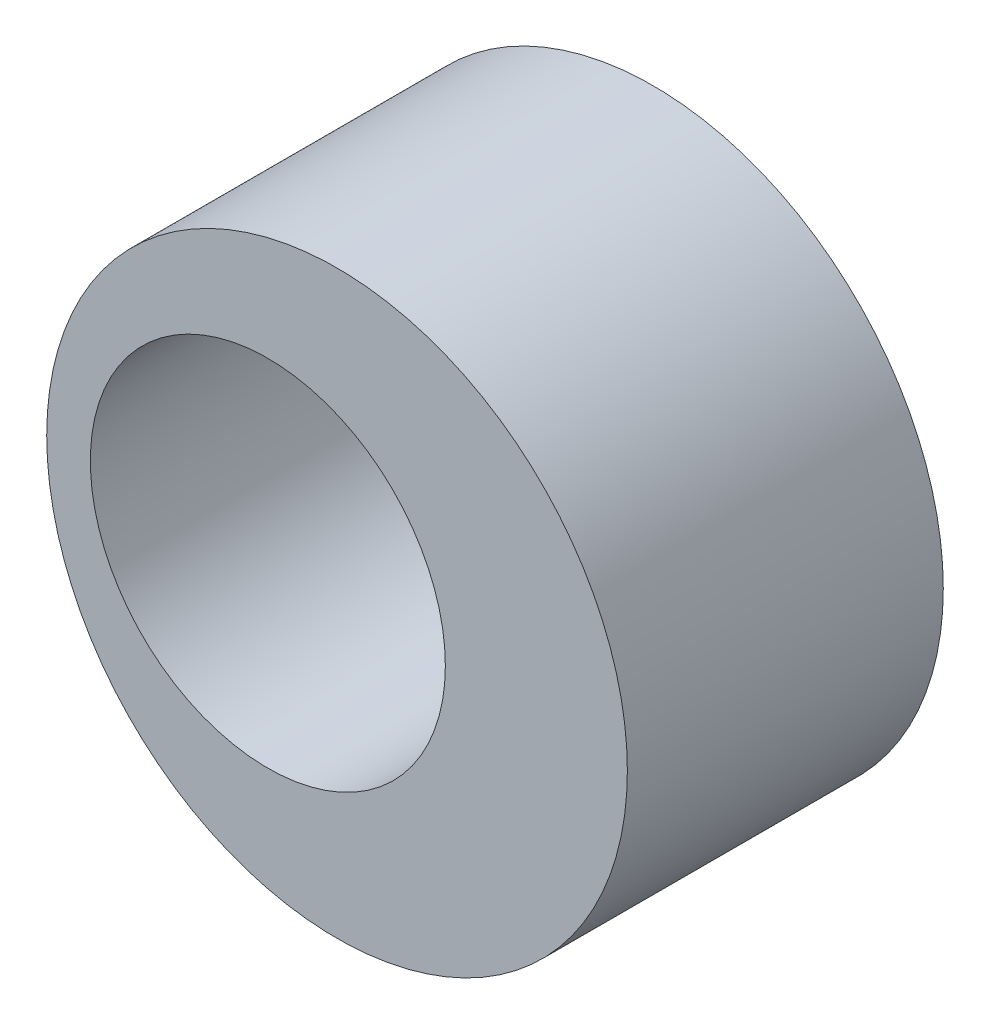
ISO-10303-21;
HEADER;
FILE_DESCRIPTION(('STEP AP214'),'2;1');
FILE_NAME('part.step','',(''),(''),'','','');
FILE_SCHEMA(('AUTOMOTIVE_DESIGN { 1 0 10303 214 1 1 1 1 }'));
ENDSEC;
DATA;
#1=APPLICATION_CONTEXT('core data for automotive mechanical design processes');
#2=APPLICATION_PROTOCOL_DEFINITION('international standard','automotive_design',2000,#1);
#3=PRODUCT_CONTEXT('',#1,'mechanical');
#4=PRODUCT('Part','Part','',(#3));
#5=PRODUCT_RELATED_PRODUCT_CATEGORY('part','',(#4));
#6=PRODUCT_DEFINITION_FORMATION('','',#4);
#7=PRODUCT_DEFINITION_CONTEXT('part definition',#1,'design');
#8=PRODUCT_DEFINITION('design','',#6,#7);
#9=PRODUCT_DEFINITION_SHAPE('','',#8);
#10=(LENGTH_UNIT() NAMED_UNIT(*) SI_UNIT(.MILLI.,.METRE.));
#11=(NAMED_UNIT(*) PLANE_ANGLE_UNIT() SI_UNIT($,.RADIAN.));
#12=(NAMED_UNIT(*) SI_UNIT($,.STERADIAN.) SOLID_ANGLE_UNIT());
#13=UNCERTAINTY_MEASURE_WITH_UNIT(LENGTH_MEASURE(1.E-05),#10,'distance_accuracy_value','');
#14=(GEOMETRIC_REPRESENTATION_CONTEXT(3) GLOBAL_UNCERTAINTY_ASSIGNED_CONTEXT((#13)) GLOBAL_UNIT_ASSIGNED_CONTEXT((#10,
#11,#12)) REPRESENTATION_CONTEXT('',''));
#15=CARTESIAN_POINT('',(0.,0.,0.));
#16=DIRECTION('',(0.,0.,1.));
#17=DIRECTION('',(1.,0.,0.));
#18=AXIS2_PLACEMENT_3D('',#15,#16,#17);
#19=CARTESIAN_POINT('',(1.1684,0.,5.715));
#20=DIRECTION('',(0.,0.,-1.));
#21=DIRECTION('',(-0.999999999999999,0.,0.));
#22=AXIS2_PLACEMENT_3D('',#19,#20,#21);
#23=CYLINDRICAL_SURFACE('',#22,4.9022);
#24=CARTESIAN_POINT('',(1.1684,0.,5.715));
#25=DIRECTION('',(0.,0.,1.));
#26=DIRECTION('',(0.999999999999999,0.,0.));
#27=AXIS2_PLACEMENT_3D('',#24,#25,#26);
#28=CIRCLE('',#27,4.9022);
#29=CARTESIAN_POINT('',(6.07059999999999,0.,5.715));
#30=VERTEX_POINT('',#29);
#31=EDGE_CURVE('E11',#30,#30,#28,.T.);
#32=ORIENTED_EDGE('',*,*,#31,.F.);
#33=EDGE_LOOP('',(#32));
#34=FACE_BOUND('',#33,.T.);
#35=CARTESIAN_POINT('',(1.1684,0.,0.380999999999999));
#36=DIRECTION('',(0.,0.,-1.));
#37=DIRECTION('',(-0.999999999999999,0.,0.));
#38=AXIS2_PLACEMENT_3D('',#35,#36,#37);
#39=CIRCLE('',#38,4.9022);
#40=CARTESIAN_POINT('',(-3.73379999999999,0.,0.380999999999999));
#41=VERTEX_POINT('',#40);
#42=EDGE_CURVE('E34',#41,#41,#39,.T.);
#43=ORIENTED_EDGE('',*,*,#42,.F.);
#44=EDGE_LOOP('',(#43));
#45=FACE_BOUND('',#44,.T.);
#46=ADVANCED_FACE('F31',(#34,#45),#23,.T.);
#47=CARTESIAN_POINT('',(1.1684,0.,0.));
#48=DIRECTION('',(0.,0.,1.));
#49=DIRECTION('',(0.999999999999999,0.,0.));
#50=AXIS2_PLACEMENT_3D('',#47,#48,#49);
#51=PLANE('',#50);
#52=CARTESIAN_POINT('',(0.,0.,0.));
#53=DIRECTION('',(0.,0.,1.));
#54=DIRECTION('',(0.999999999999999,0.,0.));
#55=AXIS2_PLACEMENT_3D('',#52,#53,#54);
#56=CIRCLE('',#55,2.9972);
#57=CARTESIAN_POINT('',(2.9972,0.,0.));
#58=VERTEX_POINT('',#57);
#59=EDGE_CURVE('E38',#58,#58,#56,.T.);
#60=ORIENTED_EDGE('',*,*,#59,.T.);
#61=EDGE_LOOP('',(#60));
#62=FACE_BOUND('',#61,.T.);
#63=CARTESIAN_POINT('',(0.,0.,0.));
#64=DIRECTION('',(0.,0.,-1.));
#65=DIRECTION('',(-0.999999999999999,0.,0.));
#66=AXIS2_PLACEMENT_3D('',#63,#64,#65);
#67=CIRCLE('',#66,3.556);
#68=CARTESIAN_POINT('',(-3.556,0.,0.));
#69=VERTEX_POINT('',#68);
#70=EDGE_CURVE('E47',#69,#69,#67,.T.);
#71=ORIENTED_EDGE('',*,*,#70,.T.);
#72=EDGE_LOOP('',(#71));
#73=FACE_BOUND('',#72,.T.);
#74=ADVANCED_FACE('F60',(#62,#73),#51,.F.);
#75=CARTESIAN_POINT('',(1.1684,0.,5.715));
#76=DIRECTION('',(0.,0.,1.));
#77=DIRECTION('',(0.999999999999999,0.,0.));
#78=AXIS2_PLACEMENT_3D('',#75,#76,#77);
#79=PLANE('',#78);
#80=CARTESIAN_POINT('',(0.,0.,5.715));
#81=DIRECTION('',(0.,0.,1.));
#82=DIRECTION('',(0.999999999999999,0.,0.));
#83=AXIS2_PLACEMENT_3D('',#80,#81,#82);
#84=CIRCLE('',#83,2.9972);
#85=CARTESIAN_POINT('',(2.99720000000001,0.,5.715));
#86=VERTEX_POINT('',#85);
#87=EDGE_CURVE('E42',#86,#86,#84,.T.);
#88=ORIENTED_EDGE('',*,*,#87,.F.);
#89=EDGE_LOOP('',(#88));
#90=FACE_BOUND('',#89,.T.);
#91=ORIENTED_EDGE('',*,*,#31,.T.);
#92=EDGE_LOOP('',(#91));
#93=FACE_BOUND('',#92,.T.);
#94=ADVANCED_FACE('F65',(#90,#93),#79,.T.);
#95=CARTESIAN_POINT('',(0.,0.,0.));
#96=DIRECTION('',(0.,0.,1.));
#97=DIRECTION('',(0.999999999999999,0.,0.));
#98=AXIS2_PLACEMENT_3D('',#95,#96,#97);
#99=CYLINDRICAL_SURFACE('',#98,2.9972);
#100=ORIENTED_EDGE('',*,*,#59,.F.);
#101=EDGE_LOOP('',(#100));
#102=FACE_BOUND('',#101,.T.);
#103=ORIENTED_EDGE('',*,*,#87,.T.);
#104=EDGE_LOOP('',(#103));
#105=FACE_BOUND('',#104,.T.);
#106=ADVANCED_FACE('F70',(#102,#105),#99,.F.);
#107=CARTESIAN_POINT('',(1.1684,0.,0.380999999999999));
#108=DIRECTION('',(0.,0.,-1.));
#109=DIRECTION('',(-0.999999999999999,0.,0.));
#110=AXIS2_PLACEMENT_3D('',#107,#108,#109);
#111=PLANE('',#110);
#112=CARTESIAN_POINT('',(0.,0.,0.380999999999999));
#113=DIRECTION('',(0.,0.,-1.));
#114=DIRECTION('',(-0.999999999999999,0.,0.));
#115=AXIS2_PLACEMENT_3D('',#112,#113,#114);
#116=CIRCLE('',#115,3.556);
#117=CARTESIAN_POINT('',(-3.556,0.,0.380999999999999));
#118=VERTEX_POINT('',#117);
#119=EDGE_CURVE('E50',#118,#118,#116,.T.);
#120=ORIENTED_EDGE('',*,*,#119,.F.);
#121=EDGE_LOOP('',(#120));
#122=FACE_BOUND('',#121,.T.);
#123=ORIENTED_EDGE('',*,*,#42,.T.);
#124=EDGE_LOOP('',(#123));
#125=FACE_BOUND('',#124,.T.);
#126=ADVANCED_FACE('F57',(#122,#125),#111,.T.);
#127=CARTESIAN_POINT('',(0.,0.,0.380999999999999));
#128=DIRECTION('',(0.,0.,-1.));
#129=DIRECTION('',(-0.999999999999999,0.,0.));
#130=AXIS2_PLACEMENT_3D('',#127,#128,#129);
#131=CYLINDRICAL_SURFACE('',#130,3.556);
#132=CARTESIAN_POINT('',(-3.556,0.,0.380999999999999));
#133=CARTESIAN_POINT('',(-3.556,0.,0.377031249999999));
#134=CARTESIAN_POINT('',(-3.556,0.,0.373062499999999));
#135=CARTESIAN_POINT('',(-3.556,0.,0.365124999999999));
#136=CARTESIAN_POINT('',(-3.556,0.,0.36115625));
#137=CARTESIAN_POINT('',(-3.556,0.,0.353218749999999));
#138=CARTESIAN_POINT('',(-3.556,0.,0.34925));
#139=CARTESIAN_POINT('',(-3.556,0.,0.3413125));
#140=CARTESIAN_POINT('',(-3.556,0.,0.33734375));
#141=CARTESIAN_POINT('',(-3.556,0.,0.32940625));
#142=CARTESIAN_POINT('',(-3.556,0.,0.3254375));
#143=CARTESIAN_POINT('',(-3.556,0.,0.3175));
#144=CARTESIAN_POINT('',(-3.556,0.,0.31353125));
#145=CARTESIAN_POINT('',(-3.556,0.,0.30559375));
#146=CARTESIAN_POINT('',(-3.556,0.,0.301625));
#147=CARTESIAN_POINT('',(-3.556,0.,0.2936875));
#148=CARTESIAN_POINT('',(-3.556,0.,0.28971875));
#149=CARTESIAN_POINT('',(-3.556,0.,0.28178125));
#150=CARTESIAN_POINT('',(-3.556,0.,0.2778125));
#151=CARTESIAN_POINT('',(-3.556,0.,0.269875));
#152=CARTESIAN_POINT('',(-3.556,0.,0.26590625));
#153=CARTESIAN_POINT('',(-3.556,0.,0.25796875));
#154=CARTESIAN_POINT('',(-3.556,0.,0.254));
#155=CARTESIAN_POINT('',(-3.556,0.,0.2460625));
#156=CARTESIAN_POINT('',(-3.556,0.,0.24209375));
#157=CARTESIAN_POINT('',(-3.556,0.,0.23415625));
#158=CARTESIAN_POINT('',(-3.556,0.,0.2301875));
#159=CARTESIAN_POINT('',(-3.556,0.,0.22225));
#160=CARTESIAN_POINT('',(-3.556,0.,0.21828125));
#161=CARTESIAN_POINT('',(-3.556,0.,0.21034375));
#162=CARTESIAN_POINT('',(-3.556,0.,0.206375));
#163=CARTESIAN_POINT('',(-3.556,0.,0.1984375));
#164=CARTESIAN_POINT('',(-3.556,0.,0.19446875));
#165=CARTESIAN_POINT('',(-3.556,0.,0.18653125));
#166=CARTESIAN_POINT('',(-3.556,0.,0.1825625));
#167=CARTESIAN_POINT('',(-3.556,0.,0.174625));
#168=CARTESIAN_POINT('',(-3.556,0.,0.17065625));
#169=CARTESIAN_POINT('',(-3.556,0.,0.16271875));
#170=CARTESIAN_POINT('',(-3.556,0.,0.15875));
#171=CARTESIAN_POINT('',(-3.556,0.,0.1508125));
#172=CARTESIAN_POINT('',(-3.556,0.,0.14684375));
#173=CARTESIAN_POINT('',(-3.556,0.,0.13890625));
#174=CARTESIAN_POINT('',(-3.556,0.,0.1349375));
#175=CARTESIAN_POINT('',(-3.556,0.,0.127));
#176=CARTESIAN_POINT('',(-3.556,0.,0.12303125));
#177=CARTESIAN_POINT('',(-3.556,0.,0.11509375));
#178=CARTESIAN_POINT('',(-3.556,0.,0.111125));
#179=CARTESIAN_POINT('',(-3.556,0.,0.1031875));
#180=CARTESIAN_POINT('',(-3.556,0.,0.0992187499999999));
#181=CARTESIAN_POINT('',(-3.556,0.,0.0912812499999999));
#182=CARTESIAN_POINT('',(-3.556,0.,0.0873124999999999));
#183=CARTESIAN_POINT('',(-3.556,0.,0.0793749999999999));
#184=CARTESIAN_POINT('',(-3.556,0.,0.0754062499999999));
#185=CARTESIAN_POINT('',(-3.556,0.,0.0674687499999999));
#186=CARTESIAN_POINT('',(-3.556,0.,0.0635));
#187=CARTESIAN_POINT('',(-3.556,0.,0.0555625));
#188=CARTESIAN_POINT('',(-3.556,0.,0.05159375));
#189=CARTESIAN_POINT('',(-3.556,0.,0.04365625));
#190=CARTESIAN_POINT('',(-3.556,0.,0.0396875));
#191=CARTESIAN_POINT('',(-3.556,0.,0.03175));
#192=CARTESIAN_POINT('',(-3.556,0.,0.02778125));
#193=CARTESIAN_POINT('',(-3.556,0.,0.01984375));
#194=CARTESIAN_POINT('',(-3.556,0.,0.015875));
#195=CARTESIAN_POINT('',(-3.556,0.,0.00793750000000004));
#196=CARTESIAN_POINT('',(-3.556,0.,0.00396875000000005));
#197=CARTESIAN_POINT('',(-3.556,0.,0.));
#198=B_SPLINE_CURVE_WITH_KNOTS('',3,(#132,#133,#134,#135,#136,#137,#138,#139,#140,#141,#142,
#143,#144,#145,#146,#147,#148,#149,#150,#151,#152,#153,#154,#155,#156,#157,#158,#159,#160,#161,
#162,#163,#164,#165,#166,#167,#168,#169,#170,#171,#172,#173,#174,#175,#176,#177,#178,#179,#180,
#181,#182,#183,#184,#185,#186,#187,#188,#189,#190,#191,#192,#193,#194,#195,#196,#197),
.UNSPECIFIED.,.F.,.F.,(4,2,2,2,2,2,2,2,2,2,2,2,2,2,2,2,2,2,2,2,2,2,2,2,2,2,2,2,2,2,2,2,4),(0.,
0.0119062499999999,0.0238124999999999,0.0357187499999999,0.0476249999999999,0.0595312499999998,
0.0714374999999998,0.0833437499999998,0.0952499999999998,0.10715625,0.1190625,0.13096875,
0.142875,0.15478125,0.1666875,0.17859375,0.1905,0.20240625,0.2143125,0.22621875,0.238125,
0.25003125,0.2619375,0.273843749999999,0.28575,0.297656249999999,0.309562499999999,
0.321468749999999,0.333374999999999,0.345281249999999,0.357187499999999,0.369093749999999,
0.380999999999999),.UNSPECIFIED.);
#199=EDGE_CURVE('BSEAM80',#118,#69,#198,.T.);
#200=ORIENTED_EDGE('',*,*,#119,.T.);
#201=ORIENTED_EDGE('',*,*,#70,.F.);
#202=ORIENTED_EDGE('',*,*,#199,.T.);
#203=ORIENTED_EDGE('',*,*,#199,.F.);
#204=EDGE_LOOP('',(#200,#202,#201,#203));
#205=FACE_BOUND('',#204,.T.);
#206=ADVANCED_FACE('F80',(#205),#131,.T.);
#207=CLOSED_SHELL('',(#46,#74,#94,#106,#126,#206));
#208=MANIFOLD_SOLID_BREP('B2',#207);
#209=ADVANCED_BREP_SHAPE_REPRESENTATION('',(#18,#208),#14);
#210=SHAPE_DEFINITION_REPRESENTATION(#9,#209);
ENDSEC;
END-ISO-10303-21;
